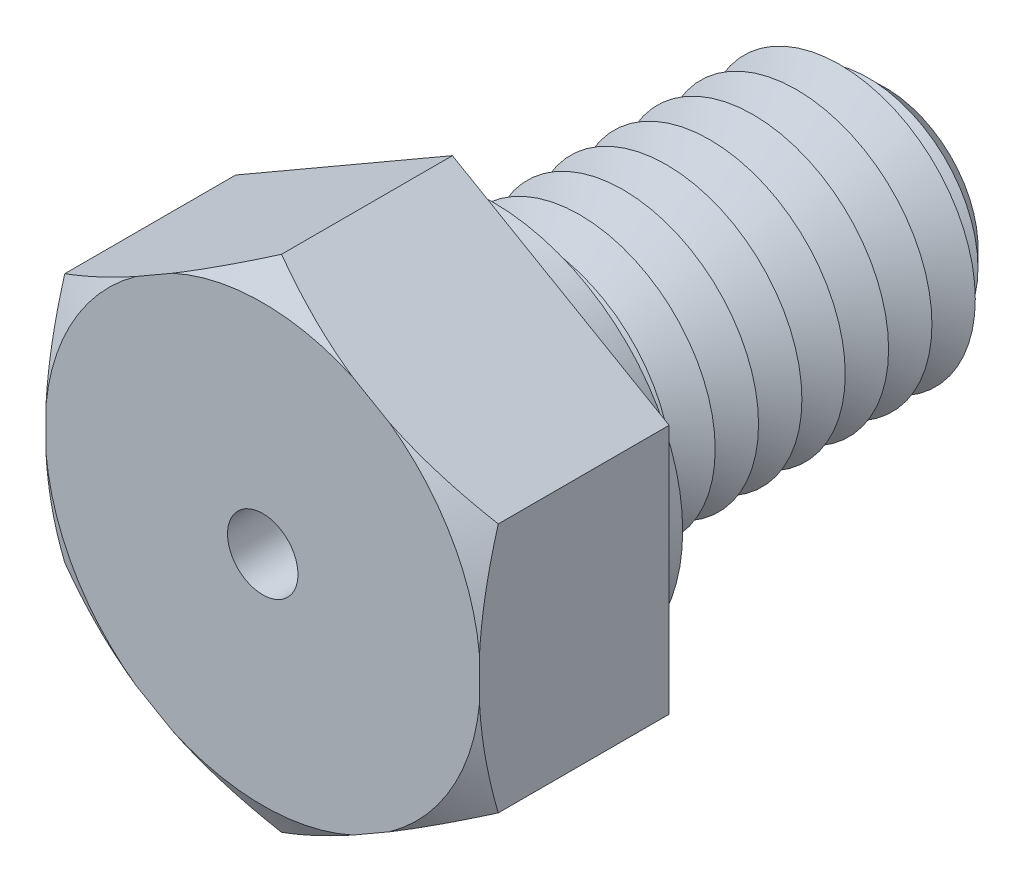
from build123d import *

# Parameters (mm, degrees)
BOSS_EXTRUDE1_DEPTH = 3.5
SKETCH3_R           = 2.5
BOSS_EXTRUDE2_DEPTH = 8
SKETCH4_R           = 3.5
BOSS_EXTRUDE3_DEPTH = 0.75
CHAMFER1_SIZE       = 0.8
LPATTERN1_COUNT     = 9
LPATTERN1_PITCH     = 0.8
SKETCH8_R           = 0.65
CUT_EXTRUDE1_DEPTH  = 11.5


with BuildPart() as part:
    # Sketch2 → Boss-Extrude1 (new body)
    with BuildSketch(Plane.XY):
        Polygon((0, 4.618802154), (-4, 2.309401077), (-4, -2.309401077), (0, -4.618802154), (4, -2.309401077), (4, 2.309401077), align=None)
    extrude(amount=BOSS_EXTRUDE1_DEPTH)

    # Sketch3 → Boss-Extrude2 (add)
    with BuildSketch(Plane(origin=(0, 0, 0), x_dir=(-1, 0, 0), z_dir=(0, 0, -1))):
        Circle(SKETCH3_R)
    extrude(amount=BOSS_EXTRUDE2_DEPTH)

    # Sketch4 → Boss-Extrude3 (add)
    with BuildSketch(Plane(origin=(0, 0, 0), x_dir=(-1, 0, 0), z_dir=(0, 0, -1))):
        with Locations(Location((0, 0, 0), (0, 0, 180))):
            Circle(SKETCH4_R)
    extrude(amount=BOSS_EXTRUDE3_DEPTH)

    # Chamfer1
    chamfer1_edges = [part.edges().sort_by_distance(p)[0] for p in [
        (2.5, 0, -8),
    ]]
    chamfer(chamfer1_edges, length=CHAMFER1_SIZE)

    # Sketch6 → Cut-Revolve1 (revolve, cut)
    with BuildSketch(Plane(origin=(0, 0, 0), x_dir=(0, 0, -1), z_dir=(1, 0, 0)), mode=Mode.PRIVATE) as cut_revolve1_sk:
        Polygon((0.75, 2.5), (1.15, 1.807179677), (1.55, 2.5), align=None)
    cut_revolve1 = revolve(cut_revolve1_sk.sketch.rotate(Axis((0, 0, 3.211670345), (0, 0, -1)), 90), axis=Axis((0, 0, 3.211670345), (0, 0, -1)), mode=Mode.SUBTRACT)

    # LPattern1: Cut-Revolve1 ×9
    with Locations(*[(0, 0, -i * LPATTERN1_PITCH) for i in range(1, LPATTERN1_COUNT)]):
        add(cut_revolve1, mode=Mode.SUBTRACT)

    # Sketch7 → Cut-Revolve2 (revolve, cut)
    with BuildSketch(Plane(origin=(0, 0, 0), x_dir=(0, 0, -1), z_dir=(1, 0, 0)), mode=Mode.PRIVATE) as cut_revolve2_sk:
        Polygon((-3.5, 4.618802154), (-3.5, 4.018802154), (-3.153589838, 4.618802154), align=None)
    revolve(cut_revolve2_sk.sketch.rotate(Axis((0, 0, 3.211670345), (0, 0, -1)), 270), axis=Axis((0, 0, 3.211670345), (0, 0, -1)), mode=Mode.SUBTRACT)

    # Sketch8 → Cut-Extrude1 (cut)
    with BuildSketch(Plane.XY.offset(3.5)):
        Circle(SKETCH8_R)
    extrude(amount=-CUT_EXTRUDE1_DEPTH, mode=Mode.SUBTRACT)


solid = part.part
